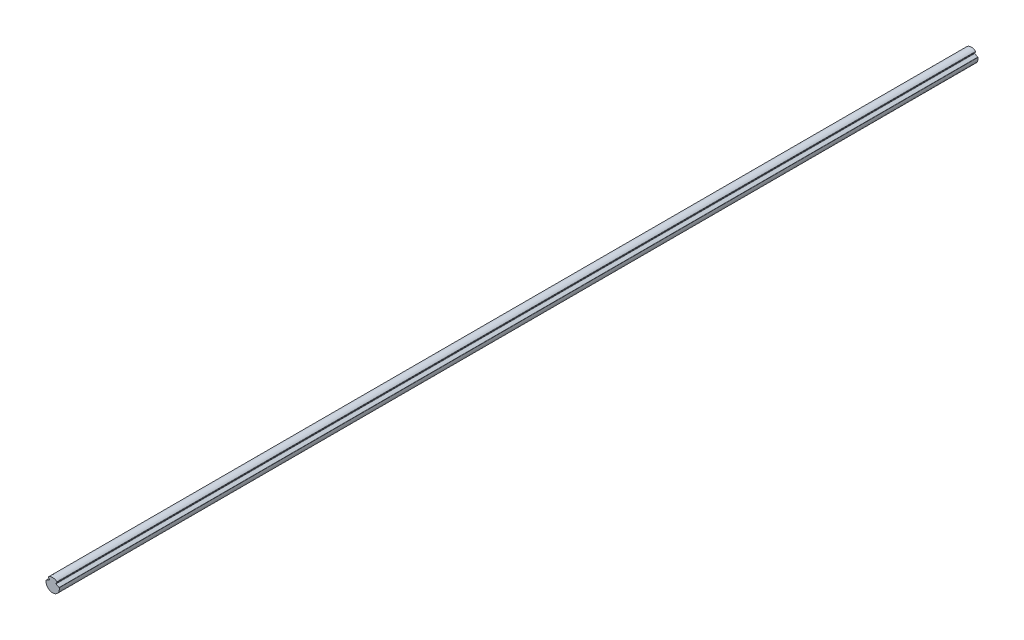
from build123d import *

# Parameters (mm, degrees)
BOSS_EXTRU_1_DEPTH = 1000


with BuildPart() as part:
    # Esquisse1 → Boss.-Extru.1 (new body)
    with BuildSketch(Plane.XY):
        with BuildLine():
            Line((3.690120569, 3.025747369), (6.957543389, 1.360912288))
            ThreePointArc((6.957543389, 1.360912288), (7.100714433, 1.238018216), (7.171622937, 1.063167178))
            ThreePointArc((7.171622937, 1.063167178), (0, -7.25), (-7.171622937, 1.063167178))
            ThreePointArc((-7.171622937, 1.063167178), (-7.100714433, 1.238018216), (-6.957543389, 1.360912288))
            Line((-6.957543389, 1.360912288), (-3.690120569, 3.025747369))
            ThreePointArc((-3.690120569, 3.025747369), (-3.480457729, 3.298985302), (-3.560858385, 3.633878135))
            Line((-3.560858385, 3.633878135), (-4.683914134, 5.020736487))
            ThreePointArc((-4.683914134, 5.020736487), (-4.771103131, 5.311939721), (-4.628416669, 5.58034579))
            ThreePointArc((-4.628416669, 5.58034579), (0, 7.25), (4.628416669, 5.58034579))
            ThreePointArc((4.628416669, 5.58034579), (4.771103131, 5.311939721), (4.683914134, 5.020736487))
            Line((4.683914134, 5.020736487), (3.560858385, 3.633878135))
            ThreePointArc((3.560858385, 3.633878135), (3.480457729, 3.298985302), (3.690120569, 3.025747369))
        make_face()
    extrude(amount=BOSS_EXTRU_1_DEPTH)


solid = part.part
